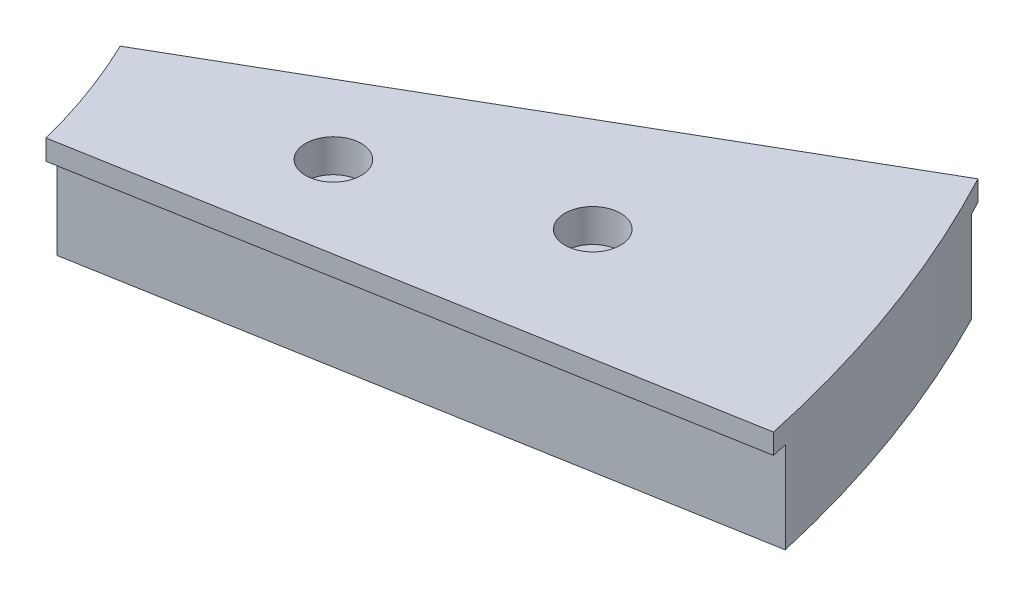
ISO-10303-21;
HEADER;
FILE_DESCRIPTION(('STEP AP214'),'2;1');
FILE_NAME('part.step','',(''),(''),'','','');
FILE_SCHEMA(('AUTOMOTIVE_DESIGN { 1 0 10303 214 1 1 1 1 }'));
ENDSEC;
DATA;
#1=APPLICATION_CONTEXT('core data for automotive mechanical design processes');
#2=APPLICATION_PROTOCOL_DEFINITION('international standard','automotive_design',2000,#1);
#3=PRODUCT_CONTEXT('',#1,'mechanical');
#4=PRODUCT('Part','Part','',(#3));
#5=PRODUCT_RELATED_PRODUCT_CATEGORY('part','',(#4));
#6=PRODUCT_DEFINITION_FORMATION('','',#4);
#7=PRODUCT_DEFINITION_CONTEXT('part definition',#1,'design');
#8=PRODUCT_DEFINITION('design','',#6,#7);
#9=PRODUCT_DEFINITION_SHAPE('','',#8);
#10=(LENGTH_UNIT() NAMED_UNIT(*) SI_UNIT(.MILLI.,.METRE.));
#11=(NAMED_UNIT(*) PLANE_ANGLE_UNIT() SI_UNIT($,.RADIAN.));
#12=(NAMED_UNIT(*) SI_UNIT($,.STERADIAN.) SOLID_ANGLE_UNIT());
#13=UNCERTAINTY_MEASURE_WITH_UNIT(LENGTH_MEASURE(1.E-05),#10,'distance_accuracy_value','');
#14=(GEOMETRIC_REPRESENTATION_CONTEXT(3) GLOBAL_UNCERTAINTY_ASSIGNED_CONTEXT((#13)) GLOBAL_UNIT_ASSIGNED_CONTEXT((#10,
#11,#12)) REPRESENTATION_CONTEXT('',''));
#15=CARTESIAN_POINT('',(0.,0.,0.));
#16=DIRECTION('',(0.,0.,1.));
#17=DIRECTION('',(1.,0.,0.));
#18=AXIS2_PLACEMENT_3D('',#15,#16,#17);
#19=CARTESIAN_POINT('',(0.,17.4625,0.));
#20=DIRECTION('',(0.,-1.,0.));
#21=DIRECTION('',(0.,0.,-1.));
#22=AXIS2_PLACEMENT_3D('',#19,#20,#21);
#23=CYLINDRICAL_SURFACE('',#22,96.8375);
#24=DIRECTION('',(0.,-1.,0.));
#25=VECTOR('',#24,1.);
#26=CARTESIAN_POINT('',(93.2378191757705,17.4625,-26.1574173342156));
#27=LINE('',#26,#25);
#28=CARTESIAN_POINT('',(93.2378191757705,14.2875,-26.1574173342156));
#29=VERTEX_POINT('',#28);
#30=CARTESIAN_POINT('',(93.2378191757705,0.,-26.1574173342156));
#31=VERTEX_POINT('',#30);
#32=EDGE_CURVE('E56',#29,#31,#27,.T.);
#33=ORIENTED_EDGE('',*,*,#32,.F.);
#34=CARTESIAN_POINT('',(0.,14.2875,0.));
#35=DIRECTION('',(0.,-1.,0.));
#36=DIRECTION('',(0.,0.,-1.));
#37=AXIS2_PLACEMENT_3D('',#34,#35,#36);
#38=CIRCLE('',#37,96.8375);
#39=CARTESIAN_POINT('',(93.8659717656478,14.2875,-23.8050572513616));
#40=VERTEX_POINT('',#39);
#41=EDGE_CURVE('E166',#40,#29,#38,.F.);
#42=ORIENTED_EDGE('',*,*,#41,.F.);
#43=DIRECTION('',(0.,-1.,0.));
#44=VECTOR('',#43,1.);
#45=CARTESIAN_POINT('',(93.8659717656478,17.4625,-23.8050572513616));
#46=LINE('',#45,#44);
#47=CARTESIAN_POINT('',(93.8659717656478,17.4625,-23.8050572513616));
#48=VERTEX_POINT('',#47);
#49=EDGE_CURVE('E193',#48,#40,#46,.T.);
#50=ORIENTED_EDGE('',*,*,#49,.F.);
#51=CARTESIAN_POINT('',(0.,17.4625,0.));
#52=DIRECTION('',(0.,-1.,0.));
#53=DIRECTION('',(0.,0.,1.));
#54=AXIS2_PLACEMENT_3D('',#51,#52,#53);
#55=CIRCLE('',#54,96.8375);
#56=CARTESIAN_POINT('',(87.2071019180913,17.4625,-42.1001517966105));
#57=VERTEX_POINT('',#56);
#58=EDGE_CURVE('E169',#57,#48,#55,.T.);
#59=ORIENTED_EDGE('',*,*,#58,.F.);
#60=DIRECTION('',(0.,-1.,0.));
#61=VECTOR('',#60,1.);
#62=CARTESIAN_POINT('',(87.2071019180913,17.4625,-42.1001517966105));
#63=LINE('',#62,#61);
#64=CARTESIAN_POINT('',(87.2071019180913,14.2875,-42.1001517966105));
#65=VERTEX_POINT('',#64);
#66=EDGE_CURVE('E179',#57,#65,#63,.T.);
#67=ORIENTED_EDGE('',*,*,#66,.T.);
#68=CARTESIAN_POINT('',(88.2379770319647,14.2875,-39.8943707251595));
#69=VERTEX_POINT('',#68);
#70=EDGE_CURVE('E163',#69,#65,#38,.F.);
#71=ORIENTED_EDGE('',*,*,#70,.F.);
#72=DIRECTION('',(0.,-1.,0.));
#73=VECTOR('',#72,1.);
#74=CARTESIAN_POINT('',(88.2379770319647,17.4625,-39.8943707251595));
#75=LINE('',#74,#73);
#76=CARTESIAN_POINT('',(88.2379770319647,0.,-39.8943707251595));
#77=VERTEX_POINT('',#76);
#78=EDGE_CURVE('E159',#77,#69,#75,.F.);
#79=ORIENTED_EDGE('',*,*,#78,.F.);
#80=CARTESIAN_POINT('',(0.,0.,0.));
#81=DIRECTION('',(0.,-1.,0.));
#82=DIRECTION('',(0.,0.,1.));
#83=AXIS2_PLACEMENT_3D('',#80,#81,#82);
#84=CIRCLE('',#83,96.8375);
#85=EDGE_CURVE('E180',#77,#31,#84,.T.);
#86=ORIENTED_EDGE('',*,*,#85,.T.);
#87=EDGE_LOOP('',(#33,#42,#50,#59,#67,#71,#79,#86));
#88=FACE_BOUND('',#87,.T.);
#89=ADVANCED_FACE('F32',(#88),#23,.F.);
#90=CARTESIAN_POINT('',(93.8659717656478,17.4625,-23.8050572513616));
#91=DIRECTION('',(-0.173648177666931,0.,-0.984807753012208));
#92=DIRECTION('',(-0.984807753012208,0.,0.173648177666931));
#93=AXIS2_PLACEMENT_3D('',#90,#91,#92);
#94=PLANE('',#93);
#95=DIRECTION('',(-0.984807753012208,0.,0.173648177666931));
#96=VECTOR('',#95,1.);
#97=CARTESIAN_POINT('',(93.8659717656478,14.2875,-23.8050572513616));
#98=LINE('',#97,#96);
#99=CARTESIAN_POINT('',(190.9267885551,14.2875,-40.9194980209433));
#100=VERTEX_POINT('',#99);
#101=EDGE_CURVE('E167',#100,#40,#98,.T.);
#102=ORIENTED_EDGE('',*,*,#101,.F.);
#103=DIRECTION('',(0.,-1.,0.));
#104=VECTOR('',#103,1.);
#105=CARTESIAN_POINT('',(190.9267885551,17.4625,-40.9194980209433));
#106=LINE('',#105,#104);
#107=CARTESIAN_POINT('',(190.9267885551,17.4625,-40.9194980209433));
#108=VERTEX_POINT('',#107);
#109=EDGE_CURVE('E190',#108,#100,#106,.T.);
#110=ORIENTED_EDGE('',*,*,#109,.F.);
#111=DIRECTION('',(0.984807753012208,0.,-0.173648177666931));
#112=VECTOR('',#111,1.);
#113=CARTESIAN_POINT('',(93.8659717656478,17.4625,-23.8050572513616));
#114=LINE('',#113,#112);
#115=EDGE_CURVE('E172',#48,#108,#114,.T.);
#116=ORIENTED_EDGE('',*,*,#115,.F.);
#117=ORIENTED_EDGE('',*,*,#49,.T.);
#118=EDGE_LOOP('',(#102,#110,#116,#117));
#119=FACE_BOUND('',#118,.T.);
#120=ADVANCED_FACE('F221',(#119),#94,.F.);
#121=CARTESIAN_POINT('',(0.,17.4625,0.));
#122=DIRECTION('',(0.,-1.,0.));
#123=DIRECTION('',(0.,0.,-1.));
#124=AXIS2_PLACEMENT_3D('',#121,#122,#123);
#125=CYLINDRICAL_SURFACE('',#124,195.2625);
#126=DIRECTION('',(0.,-1.,0.));
#127=VECTOR('',#126,1.);
#128=CARTESIAN_POINT('',(173.683813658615,17.4625,-89.2265475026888));
#129=LINE('',#128,#127);
#130=CARTESIAN_POINT('',(173.683813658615,14.2875,-89.2265475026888));
#131=VERTEX_POINT('',#130);
#132=CARTESIAN_POINT('',(173.683813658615,0.,-89.2265475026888));
#133=VERTEX_POINT('',#132);
#134=EDGE_CURVE('E48',#131,#133,#129,.T.);
#135=ORIENTED_EDGE('',*,*,#134,.F.);
#136=CARTESIAN_POINT('',(0.,14.2875,0.));
#137=DIRECTION('',(0.,-1.,0.));
#138=DIRECTION('',(0.,0.,-1.));
#139=AXIS2_PLACEMENT_3D('',#136,#137,#138);
#140=CIRCLE('',#139,195.2625);
#141=CARTESIAN_POINT('',(172.560951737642,14.2875,-91.379219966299));
#142=VERTEX_POINT('',#141);
#143=EDGE_CURVE('E161',#142,#131,#140,.T.);
#144=ORIENTED_EDGE('',*,*,#143,.F.);
#145=DIRECTION('',(0.,-1.,0.));
#146=VECTOR('',#145,1.);
#147=CARTESIAN_POINT('',(172.560951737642,17.4625,-91.3792199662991));
#148=LINE('',#147,#146);
#149=CARTESIAN_POINT('',(172.560951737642,17.4625,-91.3792199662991));
#150=VERTEX_POINT('',#149);
#151=EDGE_CURVE('E187',#150,#142,#148,.T.);
#152=ORIENTED_EDGE('',*,*,#151,.F.);
#153=CARTESIAN_POINT('',(0.,17.4625,0.));
#154=DIRECTION('',(0.,1.,0.));
#155=DIRECTION('',(0.,0.,1.));
#156=AXIS2_PLACEMENT_3D('',#153,#154,#155);
#157=CIRCLE('',#156,195.2625);
#158=EDGE_CURVE('E175',#108,#150,#157,.T.);
#159=ORIENTED_EDGE('',*,*,#158,.F.);
#160=ORIENTED_EDGE('',*,*,#109,.T.);
#161=CARTESIAN_POINT('',(190.40323950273,14.2875,-43.2903025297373));
#162=VERTEX_POINT('',#161);
#163=EDGE_CURVE('E164',#162,#100,#140,.T.);
#164=ORIENTED_EDGE('',*,*,#163,.F.);
#165=DIRECTION('',(0.,-1.,0.));
#166=VECTOR('',#165,1.);
#167=CARTESIAN_POINT('',(190.40323950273,17.4625,-43.2903025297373));
#168=LINE('',#167,#166);
#169=CARTESIAN_POINT('',(190.40323950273,0.,-43.2903025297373));
#170=VERTEX_POINT('',#169);
#171=EDGE_CURVE('E155',#170,#162,#168,.F.);
#172=ORIENTED_EDGE('',*,*,#171,.F.);
#173=CARTESIAN_POINT('',(0.,0.,0.));
#174=DIRECTION('',(0.,1.,0.));
#175=DIRECTION('',(0.,0.,1.));
#176=AXIS2_PLACEMENT_3D('',#173,#174,#175);
#177=CIRCLE('',#176,195.2625);
#178=EDGE_CURVE('E173',#170,#133,#177,.T.);
#179=ORIENTED_EDGE('',*,*,#178,.T.);
#180=EDGE_LOOP('',(#135,#144,#152,#159,#160,#164,#172,#179));
#181=FACE_BOUND('',#180,.T.);
#182=ADVANCED_FACE('F226',(#181),#125,.T.);
#183=CARTESIAN_POINT('',(87.2071019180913,17.4625,-42.1001517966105));
#184=DIRECTION('',(0.500000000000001,0.,0.866025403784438));
#185=DIRECTION('',(0.866025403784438,0.,-0.500000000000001));
#186=AXIS2_PLACEMENT_3D('',#183,#184,#185);
#187=PLANE('',#186);
#188=DIRECTION('',(0.866025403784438,0.,-0.500000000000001));
#189=VECTOR('',#188,1.);
#190=CARTESIAN_POINT('',(87.2071019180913,14.2875,-42.1001517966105));
#191=LINE('',#190,#189);
#192=EDGE_CURVE('E11',#65,#142,#191,.T.);
#193=ORIENTED_EDGE('',*,*,#192,.F.);
#194=ORIENTED_EDGE('',*,*,#66,.F.);
#195=DIRECTION('',(-0.866025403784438,0.,0.500000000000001));
#196=VECTOR('',#195,1.);
#197=CARTESIAN_POINT('',(87.2071019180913,17.4625,-42.1001517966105));
#198=LINE('',#197,#196);
#199=EDGE_CURVE('E177',#150,#57,#198,.T.);
#200=ORIENTED_EDGE('',*,*,#199,.F.);
#201=ORIENTED_EDGE('',*,*,#151,.T.);
#202=EDGE_LOOP('',(#193,#194,#200,#201));
#203=FACE_BOUND('',#202,.T.);
#204=ADVANCED_FACE('F252',(#203),#187,.F.);
#205=CARTESIAN_POINT('',(0.,0.,0.));
#206=DIRECTION('',(0.,1.,0.));
#207=DIRECTION('',(0.,0.,1.));
#208=AXIS2_PLACEMENT_3D('',#205,#206,#207);
#209=PLANE('',#208);
#210=CARTESIAN_POINT('',(164.093823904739,0.,-59.7252675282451));
#211=DIRECTION('',(0.,-1.,0.));
#212=DIRECTION('',(0.,0.,-1.));
#213=AXIS2_PLACEMENT_3D('',#210,#211,#212);
#214=CIRCLE('',#213,2.39395000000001);
#215=CARTESIAN_POINT('',(164.093823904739,0.,-62.1192175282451));
#216=VERTEX_POINT('',#215);
#217=EDGE_CURVE('E437',#216,#216,#214,.T.);
#218=ORIENTED_EDGE('',*,*,#217,.F.);
#219=EDGE_LOOP('',(#218));
#220=FACE_BOUND('',#219,.T.);
#221=CARTESIAN_POINT('',(104.423342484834,0.,-38.0069884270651));
#222=DIRECTION('',(0.,-1.,0.));
#223=DIRECTION('',(0.,0.,-1.));
#224=AXIS2_PLACEMENT_3D('',#221,#222,#223);
#225=CIRCLE('',#224,2.39395000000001);
#226=CARTESIAN_POINT('',(104.423342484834,0.,-40.4009384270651));
#227=VERTEX_POINT('',#226);
#228=EDGE_CURVE('E113',#227,#227,#225,.T.);
#229=ORIENTED_EDGE('',*,*,#228,.F.);
#230=EDGE_LOOP('',(#229));
#231=FACE_BOUND('',#230,.T.);
#232=CARTESIAN_POINT('',(119.34096283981,0.,-43.4365582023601));
#233=DIRECTION('',(0.,1.,0.));
#234=DIRECTION('',(0.,0.,1.));
#235=AXIS2_PLACEMENT_3D('',#232,#233,#234);
#236=CIRCLE('',#235,2.8067);
#237=CARTESIAN_POINT('',(119.34096283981,0.,-40.6298582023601));
#238=VERTEX_POINT('',#237);
#239=EDGE_CURVE('E35',#238,#238,#236,.T.);
#240=ORIENTED_EDGE('',*,*,#239,.T.);
#241=EDGE_LOOP('',(#240));
#242=FACE_BOUND('',#241,.T.);
#243=CARTESIAN_POINT('',(149.176203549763,0.,-54.2956977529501));
#244=DIRECTION('',(0.,1.,0.));
#245=DIRECTION('',(0.,0.,1.));
#246=AXIS2_PLACEMENT_3D('',#243,#244,#245);
#247=CIRCLE('',#246,2.80670000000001);
#248=CARTESIAN_POINT('',(149.176203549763,0.,-51.4889977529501));
#249=VERTEX_POINT('',#248);
#250=EDGE_CURVE('E150',#249,#249,#247,.T.);
#251=ORIENTED_EDGE('',*,*,#250,.T.);
#252=EDGE_LOOP('',(#251));
#253=FACE_BOUND('',#252,.T.);
#254=DIRECTION('',(-0.866025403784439,0.,0.5));
#255=VECTOR('',#254,1.);
#256=CARTESIAN_POINT('',(4.78472499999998,0.,8.28738680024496));
#257=LINE('',#256,#255);
#258=EDGE_CURVE('E40',#133,#77,#257,.T.);
#259=ORIENTED_EDGE('',*,*,#258,.F.);
#260=ORIENTED_EDGE('',*,*,#178,.F.);
#261=DIRECTION('',(0.984807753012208,0.,-0.173648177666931));
#262=VECTOR('',#261,1.);
#263=CARTESIAN_POINT('',(-1.66171755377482,0.,-9.42406855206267));
#264=LINE('',#263,#262);
#265=EDGE_CURVE('E196',#31,#170,#264,.T.);
#266=ORIENTED_EDGE('',*,*,#265,.F.);
#267=ORIENTED_EDGE('',*,*,#85,.F.);
#268=EDGE_LOOP('',(#259,#260,#266,#267));
#269=FACE_BOUND('',#268,.T.);
#270=ADVANCED_FACE('F201',(#220,#231,#242,#253,#269),#209,.F.);
#271=CARTESIAN_POINT('',(0.,17.4625,0.));
#272=DIRECTION('',(0.,1.,0.));
#273=DIRECTION('',(0.,0.,1.));
#274=AXIS2_PLACEMENT_3D('',#271,#272,#273);
#275=PLANE('',#274);
#276=CARTESIAN_POINT('',(119.34096283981,17.4624999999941,-43.4365582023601));
#277=DIRECTION('',(0.,1.,0.));
#278=DIRECTION('',(0.,0.,1.));
#279=AXIS2_PLACEMENT_3D('',#276,#277,#278);
#280=CIRCLE('',#279,4.36562500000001);
#281=CARTESIAN_POINT('',(119.34096283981,17.4624999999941,-39.0709332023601));
#282=VERTEX_POINT('',#281);
#283=EDGE_CURVE('E132',#282,#282,#280,.T.);
#284=ORIENTED_EDGE('',*,*,#283,.F.);
#285=EDGE_LOOP('',(#284));
#286=FACE_BOUND('',#285,.T.);
#287=CARTESIAN_POINT('',(149.176203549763,17.4624999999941,-54.2956977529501));
#288=DIRECTION('',(0.,1.,0.));
#289=DIRECTION('',(0.,0.,1.));
#290=AXIS2_PLACEMENT_3D('',#287,#288,#289);
#291=CIRCLE('',#290,4.36562500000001);
#292=CARTESIAN_POINT('',(149.176203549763,17.4624999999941,-49.9300727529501));
#293=VERTEX_POINT('',#292);
#294=EDGE_CURVE('E141',#293,#293,#291,.T.);
#295=ORIENTED_EDGE('',*,*,#294,.F.);
#296=EDGE_LOOP('',(#295));
#297=FACE_BOUND('',#296,.T.);
#298=ORIENTED_EDGE('',*,*,#58,.T.);
#299=ORIENTED_EDGE('',*,*,#115,.T.);
#300=ORIENTED_EDGE('',*,*,#158,.T.);
#301=ORIENTED_EDGE('',*,*,#199,.T.);
#302=EDGE_LOOP('',(#298,#299,#300,#301));
#303=FACE_BOUND('',#302,.T.);
#304=ADVANCED_FACE('F247',(#286,#297,#303),#275,.T.);
#305=CARTESIAN_POINT('',(76.2,14.2875,-23.1531901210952));
#306=DIRECTION('',(0.173648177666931,0.,0.984807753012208));
#307=DIRECTION('',(0.984807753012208,0.,-0.173648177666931));
#308=AXIS2_PLACEMENT_3D('',#305,#306,#307);
#309=PLANE('',#308);
#310=ORIENTED_EDGE('',*,*,#32,.T.);
#311=ORIENTED_EDGE('',*,*,#265,.T.);
#312=ORIENTED_EDGE('',*,*,#171,.T.);
#313=DIRECTION('',(-0.984807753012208,0.,0.173648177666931));
#314=VECTOR('',#313,1.);
#315=CARTESIAN_POINT('',(76.2,14.2875,-23.1531901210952));
#316=LINE('',#315,#314);
#317=EDGE_CURVE('E153',#162,#29,#316,.T.);
#318=ORIENTED_EDGE('',*,*,#317,.T.);
#319=EDGE_LOOP('',(#310,#311,#312,#318));
#320=FACE_BOUND('',#319,.T.);
#321=ADVANCED_FACE('F235',(#320),#309,.T.);
#322=CARTESIAN_POINT('',(76.2,14.2875,-127.));
#323=DIRECTION('',(0.,-1.,0.));
#324=DIRECTION('',(0.,0.,-1.));
#325=AXIS2_PLACEMENT_3D('',#322,#323,#324);
#326=PLANE('',#325);
#327=ORIENTED_EDGE('',*,*,#41,.T.);
#328=ORIENTED_EDGE('',*,*,#317,.F.);
#329=ORIENTED_EDGE('',*,*,#163,.T.);
#330=ORIENTED_EDGE('',*,*,#101,.T.);
#331=EDGE_LOOP('',(#327,#328,#329,#330));
#332=FACE_BOUND('',#331,.T.);
#333=ADVANCED_FACE('F243',(#332),#326,.T.);
#334=ORIENTED_EDGE('',*,*,#70,.T.);
#335=ORIENTED_EDGE('',*,*,#192,.T.);
#336=ORIENTED_EDGE('',*,*,#143,.T.);
#337=DIRECTION('',(0.866025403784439,0.,-0.5));
#338=VECTOR('',#337,1.);
#339=CARTESIAN_POINT('',(76.2,14.2875,-32.9442414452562));
#340=LINE('',#339,#338);
#341=EDGE_CURVE('E151',#69,#131,#340,.T.);
#342=ORIENTED_EDGE('',*,*,#341,.F.);
#343=EDGE_LOOP('',(#334,#335,#336,#342));
#344=FACE_BOUND('',#343,.T.);
#345=ADVANCED_FACE('F217',(#344),#326,.T.);
#346=CARTESIAN_POINT('',(76.2,14.2875,-32.9442414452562));
#347=DIRECTION('',(-0.5,0.,-0.866025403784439));
#348=DIRECTION('',(-0.866025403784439,0.,0.5));
#349=AXIS2_PLACEMENT_3D('',#346,#347,#348);
#350=PLANE('',#349);
#351=ORIENTED_EDGE('',*,*,#78,.T.);
#352=ORIENTED_EDGE('',*,*,#341,.T.);
#353=ORIENTED_EDGE('',*,*,#134,.T.);
#354=ORIENTED_EDGE('',*,*,#258,.T.);
#355=EDGE_LOOP('',(#351,#352,#353,#354));
#356=FACE_BOUND('',#355,.T.);
#357=ADVANCED_FACE('F207',(#356),#350,.T.);
#358=CARTESIAN_POINT('',(149.176203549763,17.4624999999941,-54.2956977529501));
#359=DIRECTION('',(0.,1.,0.));
#360=DIRECTION('',(0.,0.,1.));
#361=AXIS2_PLACEMENT_3D('',#358,#359,#360);
#362=CYLINDRICAL_SURFACE('',#361,2.80670000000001);
#363=CARTESIAN_POINT('',(149.176203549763,12.3031249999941,-54.2956977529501));
#364=DIRECTION('',(0.,1.,0.));
#365=DIRECTION('',(0.,0.,1.));
#366=AXIS2_PLACEMENT_3D('',#363,#364,#365);
#367=CIRCLE('',#366,2.80670000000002);
#368=CARTESIAN_POINT('',(149.176203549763,12.3031249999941,-51.4889977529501));
#369=VERTEX_POINT('',#368);
#370=EDGE_CURVE('E147',#369,#369,#367,.T.);
#371=ORIENTED_EDGE('',*,*,#370,.T.);
#372=EDGE_LOOP('',(#371));
#373=FACE_BOUND('',#372,.T.);
#374=ORIENTED_EDGE('',*,*,#250,.F.);
#375=EDGE_LOOP('',(#374));
#376=FACE_BOUND('',#375,.T.);
#377=ADVANCED_FACE('F204',(#373,#376),#362,.F.);
#378=CARTESIAN_POINT('',(151.982903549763,12.3031249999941,-54.2956977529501));
#379=DIRECTION('',(0.,-1.,0.));
#380=DIRECTION('',(0.,0.,-1.));
#381=AXIS2_PLACEMENT_3D('',#378,#379,#380);
#382=PLANE('',#381);
#383=ORIENTED_EDGE('',*,*,#370,.F.);
#384=EDGE_LOOP('',(#383));
#385=FACE_BOUND('',#384,.T.);
#386=CARTESIAN_POINT('',(149.176203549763,12.3031249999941,-54.2956977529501));
#387=DIRECTION('',(0.,1.,0.));
#388=DIRECTION('',(0.,0.,1.));
#389=AXIS2_PLACEMENT_3D('',#386,#387,#388);
#390=CIRCLE('',#389,4.36562500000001);
#391=CARTESIAN_POINT('',(149.176203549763,12.3031249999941,-49.9300727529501));
#392=VERTEX_POINT('',#391);
#393=EDGE_CURVE('E144',#392,#392,#390,.T.);
#394=ORIENTED_EDGE('',*,*,#393,.T.);
#395=EDGE_LOOP('',(#394));
#396=FACE_BOUND('',#395,.T.);
#397=ADVANCED_FACE('F206',(#385,#396),#382,.F.);
#398=CARTESIAN_POINT('',(149.176203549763,17.4624999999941,-54.2956977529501));
#399=DIRECTION('',(0.,1.,0.));
#400=DIRECTION('',(0.,0.,1.));
#401=AXIS2_PLACEMENT_3D('',#398,#399,#400);
#402=CYLINDRICAL_SURFACE('',#401,4.36562500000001);
#403=ORIENTED_EDGE('',*,*,#393,.F.);
#404=EDGE_LOOP('',(#403));
#405=FACE_BOUND('',#404,.T.);
#406=ORIENTED_EDGE('',*,*,#294,.T.);
#407=EDGE_LOOP('',(#406));
#408=FACE_BOUND('',#407,.T.);
#409=ADVANCED_FACE('F214',(#405,#408),#402,.F.);
#410=CARTESIAN_POINT('',(119.34096283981,17.4624999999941,-43.4365582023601));
#411=DIRECTION('',(0.,1.,0.));
#412=DIRECTION('',(0.,0.,1.));
#413=AXIS2_PLACEMENT_3D('',#410,#411,#412);
#414=CYLINDRICAL_SURFACE('',#413,2.8067);
#415=CARTESIAN_POINT('',(119.34096283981,12.3031249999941,-43.4365582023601));
#416=DIRECTION('',(0.,1.,0.));
#417=DIRECTION('',(0.,0.,1.));
#418=AXIS2_PLACEMENT_3D('',#415,#416,#417);
#419=CIRCLE('',#418,2.80670000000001);
#420=CARTESIAN_POINT('',(119.34096283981,12.3031249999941,-40.6298582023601));
#421=VERTEX_POINT('',#420);
#422=EDGE_CURVE('E138',#421,#421,#419,.T.);
#423=ORIENTED_EDGE('',*,*,#422,.T.);
#424=EDGE_LOOP('',(#423));
#425=FACE_BOUND('',#424,.T.);
#426=ORIENTED_EDGE('',*,*,#239,.F.);
#427=EDGE_LOOP('',(#426));
#428=FACE_BOUND('',#427,.T.);
#429=ADVANCED_FACE('F327',(#425,#428),#414,.F.);
#430=CARTESIAN_POINT('',(122.14766283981,12.3031249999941,-43.4365582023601));
#431=DIRECTION('',(0.,-1.,0.));
#432=DIRECTION('',(0.,0.,-1.));
#433=AXIS2_PLACEMENT_3D('',#430,#431,#432);
#434=PLANE('',#433);
#435=ORIENTED_EDGE('',*,*,#422,.F.);
#436=EDGE_LOOP('',(#435));
#437=FACE_BOUND('',#436,.T.);
#438=CARTESIAN_POINT('',(119.34096283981,12.3031249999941,-43.4365582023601));
#439=DIRECTION('',(0.,1.,0.));
#440=DIRECTION('',(0.,0.,1.));
#441=AXIS2_PLACEMENT_3D('',#438,#439,#440);
#442=CIRCLE('',#441,4.36562500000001);
#443=CARTESIAN_POINT('',(119.34096283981,12.3031249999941,-39.0709332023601));
#444=VERTEX_POINT('',#443);
#445=EDGE_CURVE('E135',#444,#444,#442,.T.);
#446=ORIENTED_EDGE('',*,*,#445,.T.);
#447=EDGE_LOOP('',(#446));
#448=FACE_BOUND('',#447,.T.);
#449=ADVANCED_FACE('F337',(#437,#448),#434,.F.);
#450=CARTESIAN_POINT('',(119.34096283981,17.4624999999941,-43.4365582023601));
#451=DIRECTION('',(0.,1.,0.));
#452=DIRECTION('',(0.,0.,1.));
#453=AXIS2_PLACEMENT_3D('',#450,#451,#452);
#454=CYLINDRICAL_SURFACE('',#453,4.36562500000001);
#455=ORIENTED_EDGE('',*,*,#445,.F.);
#456=EDGE_LOOP('',(#455));
#457=FACE_BOUND('',#456,.T.);
#458=ORIENTED_EDGE('',*,*,#283,.T.);
#459=EDGE_LOOP('',(#458));
#460=FACE_BOUND('',#459,.T.);
#461=ADVANCED_FACE('F344',(#457,#460),#454,.F.);
#462=CARTESIAN_POINT('',(104.423342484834,14.2875,-38.0069884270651));
#463=DIRECTION('',(0.,-1.,0.));
#464=DIRECTION('',(0.,0.,-1.));
#465=AXIS2_PLACEMENT_3D('',#462,#463,#464);
#466=CONICAL_SURFACE('',#465,2.18281250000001,1.02974425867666);
#467=CARTESIAN_POINT('',(104.423342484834,15.5990660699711,-38.0069884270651));
#468=VERTEX_POINT('',#467);
#469=VERTEX_LOOP('',#468);
#470=FACE_BOUND('',#469,.T.);
#471=CARTESIAN_POINT('',(104.423342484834,14.2875,-38.0069884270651));
#472=DIRECTION('',(0.,-1.,0.));
#473=DIRECTION('',(0.,0.,-1.));
#474=AXIS2_PLACEMENT_3D('',#471,#472,#473);
#475=CIRCLE('',#474,2.18281250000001);
#476=CARTESIAN_POINT('',(104.423342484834,14.2875,-40.1898009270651));
#477=VERTEX_POINT('',#476);
#478=EDGE_CURVE('E129',#477,#477,#475,.T.);
#479=ORIENTED_EDGE('',*,*,#478,.T.);
#480=EDGE_LOOP('',(#479));
#481=FACE_BOUND('',#480,.T.);
#482=ADVANCED_FACE('F352',(#470,#481),#466,.F.);
#483=CARTESIAN_POINT('',(104.423342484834,0.,-38.0069884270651));
#484=DIRECTION('',(0.,-1.,0.));
#485=DIRECTION('',(0.,0.,-1.));
#486=AXIS2_PLACEMENT_3D('',#483,#484,#485);
#487=CYLINDRICAL_SURFACE('',#486,2.18281250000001);
#488=ORIENTED_EDGE('',*,*,#478,.F.);
#489=EDGE_LOOP('',(#488));
#490=FACE_BOUND('',#489,.T.);
#491=CARTESIAN_POINT('',(104.423342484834,7.14375,-38.0069884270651));
#492=DIRECTION('',(0.,-1.,0.));
#493=DIRECTION('',(0.,0.,-1.));
#494=AXIS2_PLACEMENT_3D('',#491,#492,#493);
#495=CIRCLE('',#494,2.18281250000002);
#496=CARTESIAN_POINT('',(104.423342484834,7.14375,-40.1898009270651));
#497=VERTEX_POINT('',#496);
#498=EDGE_CURVE('E126',#497,#497,#495,.T.);
#499=ORIENTED_EDGE('',*,*,#498,.T.);
#500=EDGE_LOOP('',(#499));
#501=FACE_BOUND('',#500,.T.);
#502=ADVANCED_FACE('F360',(#490,#501),#487,.F.);
#503=CARTESIAN_POINT('',(106.606154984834,7.14375,-38.0069884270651));
#504=DIRECTION('',(0.,1.,0.));
#505=DIRECTION('',(0.,0.,1.));
#506=AXIS2_PLACEMENT_3D('',#503,#504,#505);
#507=PLANE('',#506);
#508=ORIENTED_EDGE('',*,*,#498,.F.);
#509=EDGE_LOOP('',(#508));
#510=FACE_BOUND('',#509,.T.);
#511=CARTESIAN_POINT('',(104.423342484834,7.14375,-38.0069884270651));
#512=DIRECTION('',(0.,-1.,0.));
#513=DIRECTION('',(0.,0.,-1.));
#514=AXIS2_PLACEMENT_3D('',#511,#512,#513);
#515=CIRCLE('',#514,2.39395000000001);
#516=CARTESIAN_POINT('',(104.423342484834,7.14375,-40.4009384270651));
#517=VERTEX_POINT('',#516);
#518=EDGE_CURVE('E117',#517,#517,#515,.T.);
#519=ORIENTED_EDGE('',*,*,#518,.T.);
#520=EDGE_LOOP('',(#519));
#521=FACE_BOUND('',#520,.T.);
#522=ADVANCED_FACE('F368',(#510,#521),#507,.F.);
#523=CARTESIAN_POINT('',(104.423342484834,0.,-38.0069884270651));
#524=DIRECTION('',(0.,-1.,0.));
#525=DIRECTION('',(0.,0.,-1.));
#526=AXIS2_PLACEMENT_3D('',#523,#524,#525);
#527=CYLINDRICAL_SURFACE('',#526,2.39395000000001);
#528=ORIENTED_EDGE('',*,*,#518,.F.);
#529=EDGE_LOOP('',(#528));
#530=FACE_BOUND('',#529,.T.);
#531=ORIENTED_EDGE('',*,*,#228,.T.);
#532=EDGE_LOOP('',(#531));
#533=FACE_BOUND('',#532,.T.);
#534=ADVANCED_FACE('F107',(#530,#533),#527,.F.);
#535=CARTESIAN_POINT('',(164.093823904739,14.2875,-59.7252675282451));
#536=DIRECTION('',(0.,-1.,0.));
#537=DIRECTION('',(0.,0.,-1.));
#538=AXIS2_PLACEMENT_3D('',#535,#536,#537);
#539=CONICAL_SURFACE('',#538,2.18281249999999,1.02974425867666);
#540=CARTESIAN_POINT('',(164.093823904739,15.5990660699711,-59.7252675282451));
#541=VERTEX_POINT('',#540);
#542=VERTEX_LOOP('',#541);
#543=FACE_BOUND('',#542,.T.);
#544=CARTESIAN_POINT('',(164.093823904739,14.2875,-59.7252675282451));
#545=DIRECTION('',(0.,-1.,0.));
#546=DIRECTION('',(0.,0.,-1.));
#547=AXIS2_PLACEMENT_3D('',#544,#545,#546);
#548=CIRCLE('',#547,2.18281249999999);
#549=CARTESIAN_POINT('',(164.093823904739,14.2875,-61.9080800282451));
#550=VERTEX_POINT('',#549);
#551=EDGE_CURVE('E111',#550,#550,#548,.T.);
#552=ORIENTED_EDGE('',*,*,#551,.T.);
#553=EDGE_LOOP('',(#552));
#554=FACE_BOUND('',#553,.T.);
#555=ADVANCED_FACE('F103',(#543,#554),#539,.F.);
#556=CARTESIAN_POINT('',(164.093823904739,0.,-59.7252675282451));
#557=DIRECTION('',(0.,-1.,0.));
#558=DIRECTION('',(0.,0.,-1.));
#559=AXIS2_PLACEMENT_3D('',#556,#557,#558);
#560=CYLINDRICAL_SURFACE('',#559,2.18281250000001);
#561=ORIENTED_EDGE('',*,*,#551,.F.);
#562=EDGE_LOOP('',(#561));
#563=FACE_BOUND('',#562,.T.);
#564=CARTESIAN_POINT('',(164.093823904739,7.14375,-59.7252675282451));
#565=DIRECTION('',(0.,-1.,0.));
#566=DIRECTION('',(0.,0.,-1.));
#567=AXIS2_PLACEMENT_3D('',#564,#565,#566);
#568=CIRCLE('',#567,2.18281250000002);
#569=CARTESIAN_POINT('',(164.093823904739,7.14375,-61.9080800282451));
#570=VERTEX_POINT('',#569);
#571=EDGE_CURVE('E114',#570,#570,#568,.T.);
#572=ORIENTED_EDGE('',*,*,#571,.T.);
#573=EDGE_LOOP('',(#572));
#574=FACE_BOUND('',#573,.T.);
#575=ADVANCED_FACE('F106',(#563,#574),#560,.F.);
#576=CARTESIAN_POINT('',(166.276636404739,7.14375,-59.7252675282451));
#577=DIRECTION('',(0.,1.,0.));
#578=DIRECTION('',(0.,0.,1.));
#579=AXIS2_PLACEMENT_3D('',#576,#577,#578);
#580=PLANE('',#579);
#581=ORIENTED_EDGE('',*,*,#571,.F.);
#582=EDGE_LOOP('',(#581));
#583=FACE_BOUND('',#582,.T.);
#584=CARTESIAN_POINT('',(164.093823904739,7.14375,-59.7252675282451));
#585=DIRECTION('',(0.,-1.,0.));
#586=DIRECTION('',(0.,0.,-1.));
#587=AXIS2_PLACEMENT_3D('',#584,#585,#586);
#588=CIRCLE('',#587,2.39395000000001);
#589=CARTESIAN_POINT('',(164.093823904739,7.14375,-62.1192175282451));
#590=VERTEX_POINT('',#589);
#591=EDGE_CURVE('E120',#590,#590,#588,.T.);
#592=ORIENTED_EDGE('',*,*,#591,.T.);
#593=EDGE_LOOP('',(#592));
#594=FACE_BOUND('',#593,.T.);
#595=ADVANCED_FACE('F392',(#583,#594),#580,.F.);
#596=CARTESIAN_POINT('',(164.093823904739,0.,-59.7252675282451));
#597=DIRECTION('',(0.,-1.,0.));
#598=DIRECTION('',(0.,0.,-1.));
#599=AXIS2_PLACEMENT_3D('',#596,#597,#598);
#600=CYLINDRICAL_SURFACE('',#599,2.39395000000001);
#601=ORIENTED_EDGE('',*,*,#591,.F.);
#602=EDGE_LOOP('',(#601));
#603=FACE_BOUND('',#602,.T.);
#604=ORIENTED_EDGE('',*,*,#217,.T.);
#605=EDGE_LOOP('',(#604));
#606=FACE_BOUND('',#605,.T.);
#607=ADVANCED_FACE('F399',(#603,#606),#600,.F.);
#608=CLOSED_SHELL('',(#89,#120,#182,#204,#270,#304,#321,#333,#345,#357,#377,#397,#409,#429,#449,
#461,#482,#502,#522,#534,#555,#575,#595,#607));
#609=MANIFOLD_SOLID_BREP('B2',#608);
#610=ADVANCED_BREP_SHAPE_REPRESENTATION('',(#18,#609),#14);
#611=SHAPE_DEFINITION_REPRESENTATION(#9,#610);
ENDSEC;
END-ISO-10303-21;
